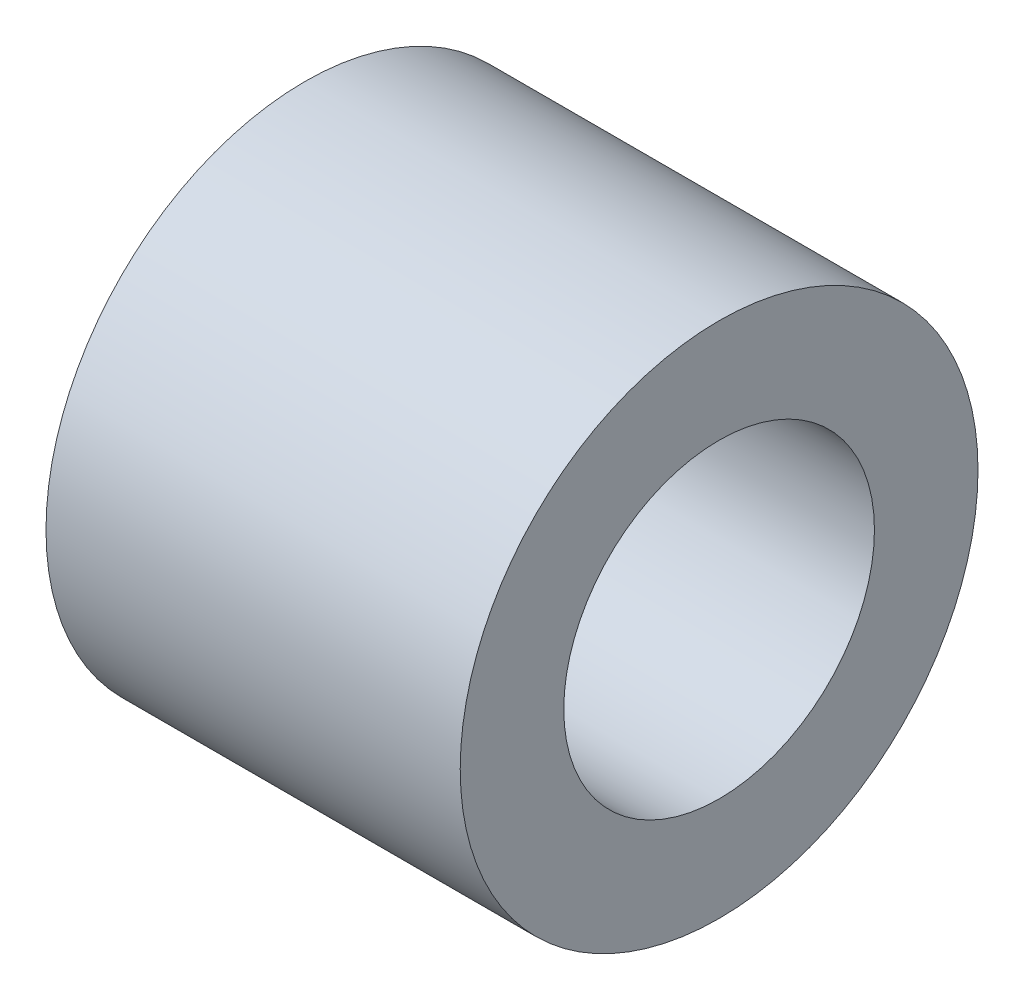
from build123d import *

# Parameters (mm, degrees)
SKETCH1_R           = 5
BOSS_EXTRUDE1_DEPTH = 8
SKETCH2_R           = 3
CUT_EXTRUDE1_DEPTH  = 6


with BuildPart() as part:
    # Sketch1 → Boss-Extrude1 (new body)
    with BuildSketch(Plane(origin=(0, 0, 0), x_dir=(0, 0, -1), z_dir=(1, 0, 0))):
        Circle(SKETCH1_R)
    extrude(amount=BOSS_EXTRUDE1_DEPTH)

    # Sketch2 → Cut-Extrude1 (cut)
    with BuildSketch(Plane(origin=(8, 0, 0), x_dir=(0, 0, -1), z_dir=(1, 0, 0))):
        Circle(SKETCH2_R)
    extrude(amount=-CUT_EXTRUDE1_DEPTH, mode=Mode.SUBTRACT)


solid = part.part
